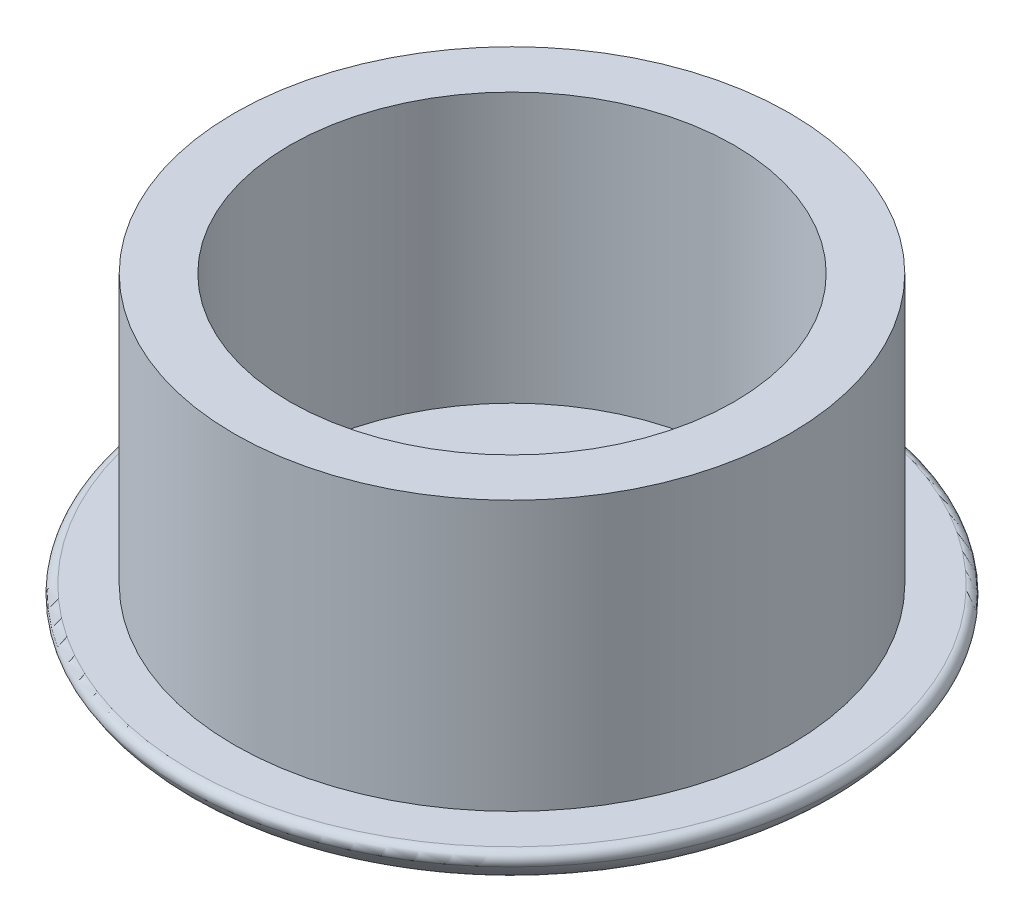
ISO-10303-21;
HEADER;
FILE_DESCRIPTION(('STEP AP214'),'2;1');
FILE_NAME('part.step','',(''),(''),'','','');
FILE_SCHEMA(('AUTOMOTIVE_DESIGN { 1 0 10303 214 1 1 1 1 }'));
ENDSEC;
DATA;
#1=APPLICATION_CONTEXT('core data for automotive mechanical design processes');
#2=APPLICATION_PROTOCOL_DEFINITION('international standard','automotive_design',2000,#1);
#3=PRODUCT_CONTEXT('',#1,'mechanical');
#4=PRODUCT('Part','Part','',(#3));
#5=PRODUCT_RELATED_PRODUCT_CATEGORY('part','',(#4));
#6=PRODUCT_DEFINITION_FORMATION('','',#4);
#7=PRODUCT_DEFINITION_CONTEXT('part definition',#1,'design');
#8=PRODUCT_DEFINITION('design','',#6,#7);
#9=PRODUCT_DEFINITION_SHAPE('','',#8);
#10=(LENGTH_UNIT() NAMED_UNIT(*) SI_UNIT(.MILLI.,.METRE.));
#11=(NAMED_UNIT(*) PLANE_ANGLE_UNIT() SI_UNIT($,.RADIAN.));
#12=(NAMED_UNIT(*) SI_UNIT($,.STERADIAN.) SOLID_ANGLE_UNIT());
#13=UNCERTAINTY_MEASURE_WITH_UNIT(LENGTH_MEASURE(1.E-05),#10,'distance_accuracy_value','');
#14=(GEOMETRIC_REPRESENTATION_CONTEXT(3) GLOBAL_UNCERTAINTY_ASSIGNED_CONTEXT((#13)) GLOBAL_UNIT_ASSIGNED_CONTEXT((#10,
#11,#12)) REPRESENTATION_CONTEXT('',''));
#15=CARTESIAN_POINT('',(0.,0.,0.));
#16=DIRECTION('',(0.,0.,1.));
#17=DIRECTION('',(1.,0.,0.));
#18=AXIS2_PLACEMENT_3D('',#15,#16,#17);
#19=CARTESIAN_POINT('',(181.924389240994,-91.9612480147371,0.0143427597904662));
#20=DIRECTION('',(0.,-1.,0.));
#21=DIRECTION('',(0.,0.,-1.));
#22=AXIS2_PLACEMENT_3D('',#19,#20,#21);
#23=PLANE('',#22);
#24=CARTESIAN_POINT('',(181.924389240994,-91.9612480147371,0.0143427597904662));
#25=DIRECTION('',(0.,-1.,0.));
#26=DIRECTION('',(0.,0.,-1.));
#27=AXIS2_PLACEMENT_3D('',#24,#25,#26);
#28=CIRCLE('',#27,10.0635083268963);
#29=CARTESIAN_POINT('',(181.924389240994,-91.9612480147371,-10.0491655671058));
#30=VERTEX_POINT('',#29);
#31=EDGE_CURVE('E49',#30,#30,#28,.T.);
#32=ORIENTED_EDGE('',*,*,#31,.T.);
#33=EDGE_LOOP('',(#32));
#34=FACE_BOUND('',#33,.T.);
#35=ADVANCED_FACE('F34',(#34),#23,.T.);
#36=CARTESIAN_POINT('',(181.924389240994,-90.4612480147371,0.0143427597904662));
#37=DIRECTION('',(0.,-1.,0.));
#38=DIRECTION('',(0.,0.,-1.));
#39=AXIS2_PLACEMENT_3D('',#36,#37,#38);
#40=PLANE('',#39);
#41=CARTESIAN_POINT('',(181.924389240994,-90.4612480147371,0.0143427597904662));
#42=DIRECTION('',(0.,-1.,0.));
#43=DIRECTION('',(0.,0.,-1.));
#44=AXIS2_PLACEMENT_3D('',#41,#42,#43);
#45=CIRCLE('',#44,10.);
#46=CARTESIAN_POINT('',(181.924389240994,-90.4612480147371,-9.98565724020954));
#47=VERTEX_POINT('',#46);
#48=EDGE_CURVE('E55',#47,#47,#45,.T.);
#49=ORIENTED_EDGE('',*,*,#48,.T.);
#50=EDGE_LOOP('',(#49));
#51=FACE_BOUND('',#50,.T.);
#52=CARTESIAN_POINT('',(181.924389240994,-90.4612480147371,0.0143427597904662));
#53=DIRECTION('',(0.,-1.,0.));
#54=DIRECTION('',(0.,0.,-1.));
#55=AXIS2_PLACEMENT_3D('',#52,#53,#54);
#56=CIRCLE('',#55,11.5635083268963);
#57=CARTESIAN_POINT('',(181.924389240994,-90.4612480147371,-11.5491655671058));
#58=VERTEX_POINT('',#57);
#59=EDGE_CURVE('E41',#58,#58,#56,.F.);
#60=ORIENTED_EDGE('',*,*,#59,.T.);
#61=EDGE_LOOP('',(#60));
#62=FACE_BOUND('',#61,.T.);
#63=ADVANCED_FACE('F77',(#51,#62),#40,.F.);
#64=CARTESIAN_POINT('',(181.924389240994,-89.9612480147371,0.0143427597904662));
#65=DIRECTION('',(0.,1.,0.));
#66=DIRECTION('',(0.,0.,1.));
#67=AXIS2_PLACEMENT_3D('',#64,#65,#66);
#68=TOROIDAL_SURFACE('',#67,10.0635083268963,2.);
#69=CARTESIAN_POINT('',(181.924389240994,-90.9024244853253,0.0143427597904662));
#70=DIRECTION('',(0.,1.,0.));
#71=DIRECTION('',(0.,0.,1.));
#72=AXIS2_PLACEMENT_3D('',#69,#70,#71);
#73=CIRCLE('',#72,11.8282142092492);
#74=CARTESIAN_POINT('',(181.924389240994,-90.9024244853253,11.8425569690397));
#75=VERTEX_POINT('',#74);
#76=EDGE_CURVE('E45',#75,#75,#73,.F.);
#77=ORIENTED_EDGE('',*,*,#76,.T.);
#78=EDGE_LOOP('',(#77));
#79=FACE_BOUND('',#78,.T.);
#80=ORIENTED_EDGE('',*,*,#31,.F.);
#81=EDGE_LOOP('',(#80));
#82=FACE_BOUND('',#81,.T.);
#83=ADVANCED_FACE('F86',(#79,#82),#68,.T.);
#84=CARTESIAN_POINT('',(181.924389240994,-90.7612480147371,0.0143427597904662));
#85=DIRECTION('',(0.,-1.,0.));
#86=DIRECTION('',(0.,0.,-1.));
#87=AXIS2_PLACEMENT_3D('',#84,#85,#86);
#88=TOROIDAL_SURFACE('',#87,11.5635083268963,0.3);
#89=ORIENTED_EDGE('',*,*,#59,.F.);
#90=EDGE_LOOP('',(#89));
#91=FACE_BOUND('',#90,.T.);
#92=ORIENTED_EDGE('',*,*,#76,.F.);
#93=EDGE_LOOP('',(#92));
#94=FACE_BOUND('',#93,.T.);
#95=ADVANCED_FACE('F36',(#91,#94),#88,.T.);
#96=CARTESIAN_POINT('',(181.924389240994,-80.7612480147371,0.0143427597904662));
#97=DIRECTION('',(0.,-1.,0.));
#98=DIRECTION('',(0.,0.,-1.));
#99=AXIS2_PLACEMENT_3D('',#96,#97,#98);
#100=CYLINDRICAL_SURFACE('',#99,10.);
#101=CARTESIAN_POINT('',(181.924389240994,-80.7612480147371,0.0143427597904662));
#102=DIRECTION('',(0.,-1.,0.));
#103=DIRECTION('',(0.,0.,-1.));
#104=AXIS2_PLACEMENT_3D('',#101,#102,#103);
#105=CIRCLE('',#104,10.);
#106=CARTESIAN_POINT('',(181.924389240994,-80.7612480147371,-9.98565724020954));
#107=VERTEX_POINT('',#106);
#108=EDGE_CURVE('E54',#107,#107,#105,.T.);
#109=ORIENTED_EDGE('',*,*,#108,.T.);
#110=EDGE_LOOP('',(#109));
#111=FACE_BOUND('',#110,.T.);
#112=ORIENTED_EDGE('',*,*,#48,.F.);
#113=EDGE_LOOP('',(#112));
#114=FACE_BOUND('',#113,.T.);
#115=ADVANCED_FACE('F78',(#111,#114),#100,.T.);
#116=CARTESIAN_POINT('',(181.924389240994,-80.7612480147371,0.0143427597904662));
#117=DIRECTION('',(0.,-1.,0.));
#118=DIRECTION('',(0.,0.,-1.));
#119=AXIS2_PLACEMENT_3D('',#116,#117,#118);
#120=PLANE('',#119);
#121=CARTESIAN_POINT('',(181.924389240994,-80.7612480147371,0.0143427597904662));
#122=DIRECTION('',(0.,-1.,0.));
#123=DIRECTION('',(1.,0.,0.));
#124=AXIS2_PLACEMENT_3D('',#121,#122,#123);
#125=CIRCLE('',#124,8.00000000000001);
#126=CARTESIAN_POINT('',(189.924389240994,-80.7612480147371,0.0143427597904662));
#127=VERTEX_POINT('',#126);
#128=EDGE_CURVE('E58',#127,#127,#125,.T.);
#129=ORIENTED_EDGE('',*,*,#128,.T.);
#130=EDGE_LOOP('',(#129));
#131=FACE_BOUND('',#130,.T.);
#132=ORIENTED_EDGE('',*,*,#108,.F.);
#133=EDGE_LOOP('',(#132));
#134=FACE_BOUND('',#133,.T.);
#135=ADVANCED_FACE('F64',(#131,#134),#120,.F.);
#136=CARTESIAN_POINT('',(181.924389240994,-80.7612480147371,0.0143427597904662));
#137=DIRECTION('',(0.,-1.,0.));
#138=DIRECTION('',(0.,0.,-1.));
#139=AXIS2_PLACEMENT_3D('',#136,#137,#138);
#140=CYLINDRICAL_SURFACE('',#139,8.00000000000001);
#141=ORIENTED_EDGE('',*,*,#128,.F.);
#142=EDGE_LOOP('',(#141));
#143=FACE_BOUND('',#142,.T.);
#144=CARTESIAN_POINT('',(181.924389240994,-90.4612480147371,0.0143427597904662));
#145=DIRECTION('',(0.,-1.,0.));
#146=DIRECTION('',(0.,0.,-1.));
#147=AXIS2_PLACEMENT_3D('',#144,#145,#146);
#148=CIRCLE('',#147,8.00000000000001);
#149=CARTESIAN_POINT('',(181.924389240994,-90.4612480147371,-7.98565724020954));
#150=VERTEX_POINT('',#149);
#151=EDGE_CURVE('E10',#150,#150,#148,.T.);
#152=ORIENTED_EDGE('',*,*,#151,.T.);
#153=EDGE_LOOP('',(#152));
#154=FACE_BOUND('',#153,.T.);
#155=ADVANCED_FACE('F67',(#143,#154),#140,.F.);
#156=ORIENTED_EDGE('',*,*,#151,.F.);
#157=EDGE_LOOP('',(#156));
#158=FACE_BOUND('',#157,.T.);
#159=ADVANCED_FACE('F69',(#158),#40,.F.);
#160=CLOSED_SHELL('',(#35,#63,#83,#95,#115,#135,#155,#159));
#161=MANIFOLD_SOLID_BREP('B2',#160);
#162=ADVANCED_BREP_SHAPE_REPRESENTATION('',(#18,#161),#14);
#163=SHAPE_DEFINITION_REPRESENTATION(#9,#162);
ENDSEC;
END-ISO-10303-21;
